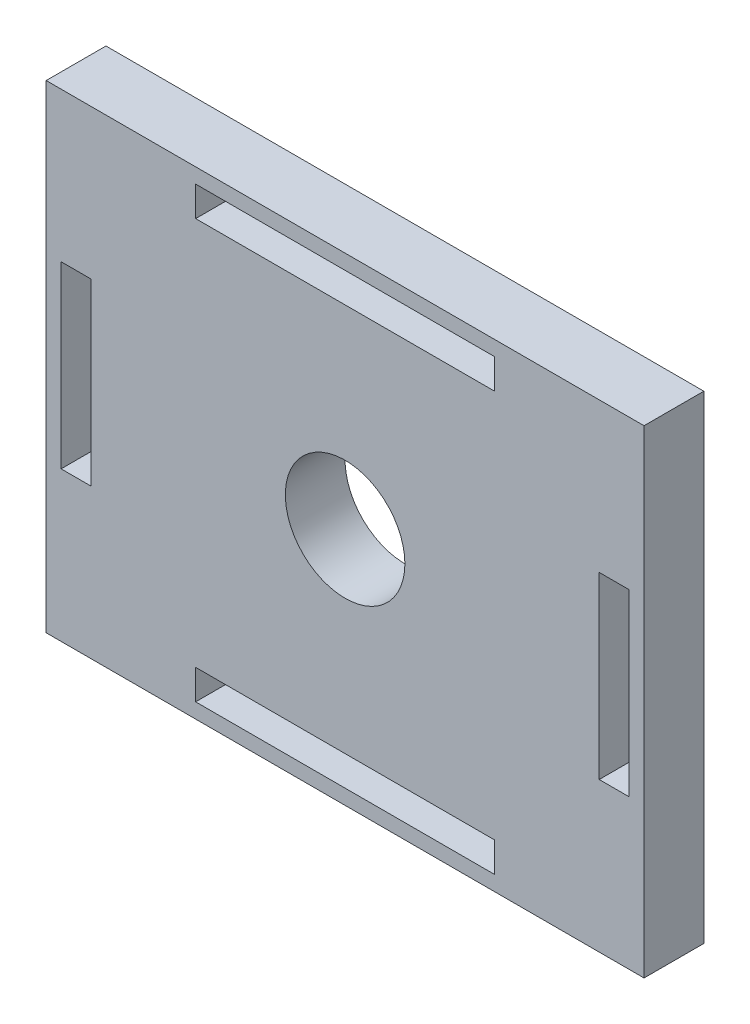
from build123d import *

# Parameters (mm, degrees)
SKETCH1_W           = 100
SKETCH1_H           = 80
SKETCH1_R           = 10
SKETCH1_W_2         = 50
SKETCH1_H_2         = 5
SKETCH1_W_3         = 5
SKETCH1_H_3         = 30
BOSS_EXTRUDE1_DEPTH = 10


with BuildPart() as part:
    # Sketch1 → Boss-Extrude1 (new body)
    with BuildSketch(Plane.XY):
        Rectangle(SKETCH1_W, SKETCH1_H)
        Circle(SKETCH1_R, mode=Mode.SUBTRACT)
        with Locations((0, -35)):
            Rectangle(SKETCH1_W_2, SKETCH1_H_2, mode=Mode.SUBTRACT)
        with Locations((0, 35)):
            Rectangle(SKETCH1_W_2, SKETCH1_H_2, mode=Mode.SUBTRACT)
        with Locations((45, 0)):
            Rectangle(SKETCH1_W_3, SKETCH1_H_3, mode=Mode.SUBTRACT)
        with Locations((-45, 0)):
            Rectangle(SKETCH1_W_3, SKETCH1_H_3, mode=Mode.SUBTRACT)
    extrude(amount=BOSS_EXTRUDE1_DEPTH)


solid = part.part
